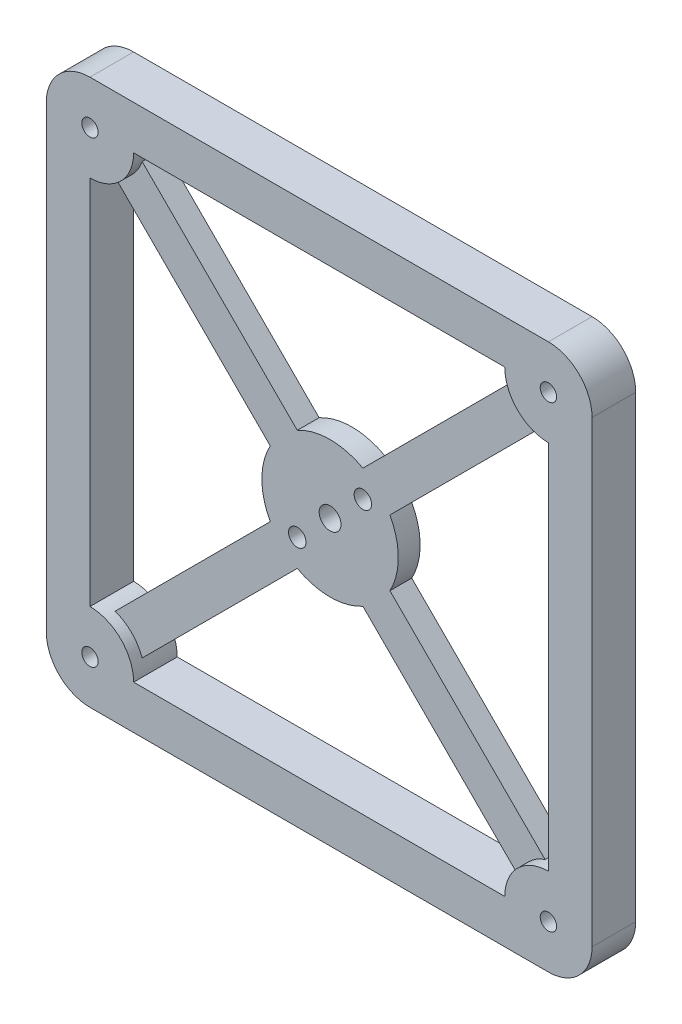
from build123d import *
from build123d.topology import SkipClean

# Parameters (mm, degrees)
SKETCH1_W           = 100
SKETCH1_H           = 100
BOSS_EXTRUDE1_DEPTH = 8
SKETCH1_3_R         = 1.6
SKETCH1_3_R_2       = 2
CUT_EXTRUDE1_DEPTH  = 72.161787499
FILLET1_R           = 8
CUT_EXTRUDE2_START  = -8
CUT_EXTRUDE2_DEPTH  = 8
SKETCH3_5_R         = 1.5
CUT_EXTRUDE3_DEPTH  = 8
CUT_EXTRUDE4_START  = -2
SKETCH3_7_R         = 12.5
SKETCH3_7_R_2       = 1.6
SKETCH3_7_R_3       = 2
CUT_EXTRUDE4_DEPTH  = 2


with BuildPart() as part:
    # Sketch1 → Boss-Extrude1 (new body)
    with BuildSketch(Plane.XY):
        Rectangle(SKETCH1_W, SKETCH1_H)
    extrude(amount=BOSS_EXTRUDE1_DEPTH)

    # Sketch1_3 → Cut-Extrude1 (cut, through all)
    with BuildSketch(Plane.XY):
        with Locations((-6.01040764, -6.01040764)):
            Circle(SKETCH1_3_R)
        with Locations((6.01040764, 6.01040764)):
            Circle(SKETCH1_3_R)
        Circle(SKETCH1_3_R_2)
    extrude(amount=CUT_EXTRUDE1_DEPTH, mode=Mode.SUBTRACT)

    # Fillet1
    fillet1_edges = [part.edges().sort_by_distance(p)[0] for p in [
        (50, -50, 4),
        (50, 50, 4),
        (-50, 50, 4),
        (-50, -50, 4),
    ]]
    fillet(fillet1_edges, radius=FILLET1_R)

    # Sketch3 → Cut-Extrude2 (cut)
    with BuildSketch(Plane(origin=(0, 0, 0), x_dir=(-1, 0, 0), z_dir=(0, 0, -1)).offset(CUT_EXTRUDE2_START)):
        with BuildLine():
            ThreePointArc((-39.388126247, 34.438378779), (-40.675796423, 34.110355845), (-42, 34))
            Line((-42, 34), (-42, -34))
            ThreePointArc((-42, -34), (-40.675796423, -34.110355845), (-39.388126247, -34.438378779))
            Line((-39.388126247, -34.438378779), (-10.960155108, -6.01040764))
            ThreePointArc((-10.960155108, -6.01040764), (-12.5, 0), (-10.960155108, 6.01040764))
            Line((-10.960155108, 6.01040764), (-39.388126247, 34.438378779))
        make_face()
        with BuildLine():
            Line((34, 42), (-34, 42))
            ThreePointArc((-34, 42), (-34.110355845, 40.675796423), (-34.438378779, 39.388126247))
            Line((-34.438378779, 39.388126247), (-6.01040764, 10.960155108))
            ThreePointArc((-6.01040764, 10.960155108), (0, 12.5), (6.01040764, 10.960155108))
            Line((6.01040764, 10.960155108), (34.438378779, 39.388126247))
            ThreePointArc((34.438378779, 39.388126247), (34.110355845, 40.675796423), (34, 42))
        make_face()
        with BuildLine():
            Line((42, -34), (42, 34))
            ThreePointArc((42, 34), (40.675796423, 34.110355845), (39.388126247, 34.438378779))
            Line((39.388126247, 34.438378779), (10.960155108, 6.01040764))
            ThreePointArc((10.960155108, 6.01040764), (12.108921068, 3.10226217), (12.5, 0))
            ThreePointArc((12.5, 0), (12.108921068, -3.10226217), (10.960155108, -6.01040764))
            Line((10.960155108, -6.01040764), (39.388126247, -34.438378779))
            ThreePointArc((39.388126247, -34.438378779), (40.675796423, -34.110355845), (42, -34))
        make_face()
        with BuildLine():
            ThreePointArc((-34.438378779, -39.388126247), (-34.110355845, -40.675796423), (-34, -42))
            Line((-34, -42), (34, -42))
            ThreePointArc((34, -42), (34.110355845, -40.675796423), (34.438378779, -39.388126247))
            Line((34.438378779, -39.388126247), (6.01040764, -10.960155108))
            ThreePointArc((6.01040764, -10.960155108), (0, -12.5), (-6.01040764, -10.960155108))
            Line((-6.01040764, -10.960155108), (-34.438378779, -39.388126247))
        make_face()
    extrude(amount=CUT_EXTRUDE2_DEPTH, mode=Mode.SUBTRACT)

    # Sketch3_5 → Cut-Extrude3 (cut)
    with BuildSketch(Plane(origin=(0, 0, 0), x_dir=(-1, 0, 0), z_dir=(0, 0, -1))):
        with Locations((-42, 42)):
            Circle(SKETCH3_5_R)
        with Locations((42, 42)):
            Circle(SKETCH3_5_R)
        with Locations((42, -42)):
            Circle(SKETCH3_5_R)
        with Locations((-42, -42)):
            Circle(SKETCH3_5_R)
    extrude(amount=-CUT_EXTRUDE3_DEPTH, mode=Mode.SUBTRACT)

    # Sketch3_7 → Cut-Extrude4 (cut)
    # profile 1 of 5: a face of its own
    with BuildSketch(Plane(origin=(0, 0, 0), x_dir=(-1, 0, 0), z_dir=(0, 0, -1)).offset(CUT_EXTRUDE4_START)):
        with BuildLine():
            Line((-6.01040764, 10.960155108), (-34.438378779, 39.388126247))
            ThreePointArc((-34.438378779, 39.388126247), (-36.343145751, 36.343145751), (-39.388126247, 34.438378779))
            Line((-39.388126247, 34.438378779), (-10.960155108, 6.01040764))
            ThreePointArc((-10.960155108, 6.01040764), (-8.838834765, 8.838834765), (-6.01040764, 10.960155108))
        make_face()
    # profile 2 of 5: a face of its own
    with BuildSketch(Plane(origin=(0, 0, 0), x_dir=(-1, 0, 0), z_dir=(0, 0, -1)).offset(CUT_EXTRUDE4_START)):
        with BuildLine():
            ThreePointArc((39.388126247, 34.438378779), (36.343145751, 36.343145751), (34.438378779, 39.388126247))
            Line((34.438378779, 39.388126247), (6.01040764, 10.960155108))
            ThreePointArc((6.01040764, 10.960155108), (8.838834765, 8.838834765), (10.960155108, 6.01040764))
            Line((10.960155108, 6.01040764), (39.388126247, 34.438378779))
        make_face()
    # profile 3 of 5: a face of its own
    with BuildSketch(Plane(origin=(0, 0, 0), x_dir=(-1, 0, 0), z_dir=(0, 0, -1)).offset(CUT_EXTRUDE4_START)):
        with BuildLine():
            ThreePointArc((34.438378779, -39.388126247), (36.343145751, -36.343145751), (39.388126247, -34.438378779))
            Line((39.388126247, -34.438378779), (10.960155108, -6.01040764))
            ThreePointArc((10.960155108, -6.01040764), (8.838834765, -8.838834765), (6.01040764, -10.960155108))
            Line((6.01040764, -10.960155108), (34.438378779, -39.388126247))
        make_face()
    # profile 4 of 5: a face of its own
    with BuildSketch(Plane(origin=(0, 0, 0), x_dir=(-1, 0, 0), z_dir=(0, 0, -1)).offset(CUT_EXTRUDE4_START)):
        with BuildLine():
            Line((-10.960155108, -6.01040764), (-39.388126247, -34.438378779))
            ThreePointArc((-39.388126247, -34.438378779), (-36.343145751, -36.343145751), (-34.438378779, -39.388126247))
            Line((-34.438378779, -39.388126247), (-6.01040764, -10.960155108))
            ThreePointArc((-6.01040764, -10.960155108), (-8.838834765, -8.838834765), (-10.960155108, -6.01040764))
        make_face()
    # profile 5 of 5: a face of its own
    with BuildSketch(Plane(origin=(0, 0, 0), x_dir=(-1, 0, 0), z_dir=(0, 0, -1)).offset(CUT_EXTRUDE4_START)):
        Circle(SKETCH3_7_R)
        with Locations((-6.01040764, 6.01040764)):
            Circle(SKETCH3_7_R_2, mode=Mode.SUBTRACT)
        with Locations((6.01040764, -6.01040764)):
            Circle(SKETCH3_7_R_2, mode=Mode.SUBTRACT)
        Circle(SKETCH3_7_R_3, mode=Mode.SUBTRACT)
    cut_extrude4 = extrude(amount=CUT_EXTRUDE4_DEPTH, mode=Mode.SUBTRACT)

    # Mirror1: Cut-Extrude4 across plane
    with SkipClean():  # the faces are left unmerged after this step: merging them gives an invalid solid
        add(cut_extrude4.mirror(Plane(origin=(0, 0, 4), x_dir=(1, 0, 0), z_dir=(0, 0, -1))), mode=Mode.SUBTRACT)


solid = part.part
